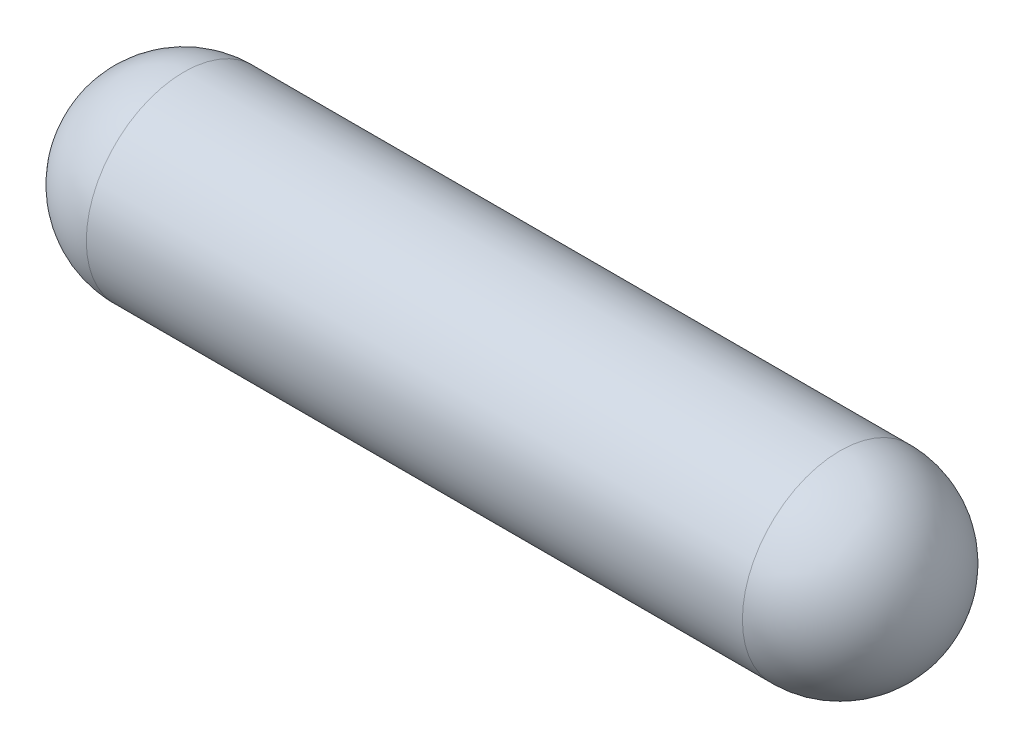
ISO-10303-21;
HEADER;
FILE_DESCRIPTION(('STEP AP214'),'2;1');
FILE_NAME('part.step','',(''),(''),'','','');
FILE_SCHEMA(('AUTOMOTIVE_DESIGN { 1 0 10303 214 1 1 1 1 }'));
ENDSEC;
DATA;
#1=APPLICATION_CONTEXT('core data for automotive mechanical design processes');
#2=APPLICATION_PROTOCOL_DEFINITION('international standard','automotive_design',2000,#1);
#3=PRODUCT_CONTEXT('',#1,'mechanical');
#4=PRODUCT('Part','Part','',(#3));
#5=PRODUCT_RELATED_PRODUCT_CATEGORY('part','',(#4));
#6=PRODUCT_DEFINITION_FORMATION('','',#4);
#7=PRODUCT_DEFINITION_CONTEXT('part definition',#1,'design');
#8=PRODUCT_DEFINITION('design','',#6,#7);
#9=PRODUCT_DEFINITION_SHAPE('','',#8);
#10=(LENGTH_UNIT() NAMED_UNIT(*) SI_UNIT(.MILLI.,.METRE.));
#11=(NAMED_UNIT(*) PLANE_ANGLE_UNIT() SI_UNIT($,.RADIAN.));
#12=(NAMED_UNIT(*) SI_UNIT($,.STERADIAN.) SOLID_ANGLE_UNIT());
#13=UNCERTAINTY_MEASURE_WITH_UNIT(LENGTH_MEASURE(1.E-05),#10,'distance_accuracy_value','');
#14=(GEOMETRIC_REPRESENTATION_CONTEXT(3) GLOBAL_UNCERTAINTY_ASSIGNED_CONTEXT((#13)) GLOBAL_UNIT_ASSIGNED_CONTEXT((#10,
#11,#12)) REPRESENTATION_CONTEXT('',''));
#15=CARTESIAN_POINT('',(0.,0.,0.));
#16=DIRECTION('',(0.,0.,1.));
#17=DIRECTION('',(1.,0.,0.));
#18=AXIS2_PLACEMENT_3D('',#15,#16,#17);
#19=CARTESIAN_POINT('',(-18.4404,2.3876,0.));
#20=DIRECTION('',(0.,0.,1.));
#21=DIRECTION('',(1.,0.,0.));
#22=AXIS2_PLACEMENT_3D('',#19,#20,#21);
#23=SPHERICAL_SURFACE('',#22,2.38759999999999);
#24=CARTESIAN_POINT('',(-18.4404,2.3876,0.));
#25=DIRECTION('',(-1.,0.,0.));
#26=DIRECTION('',(0.,0.,1.));
#27=AXIS2_PLACEMENT_3D('',#24,#25,#26);
#28=SPHERICAL_SURFACE('',#27,2.38759999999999);
#29=CARTESIAN_POINT('',(-18.4404,2.3876,0.));
#30=DIRECTION('',(-1.,0.,0.));
#31=DIRECTION('',(0.,0.,1.));
#32=AXIS2_PLACEMENT_3D('',#29,#30,#31);
#33=CIRCLE('',#32,2.38759999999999);
#34=CARTESIAN_POINT('',(-18.4404,2.3876,2.38759999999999));
#35=VERTEX_POINT('',#34);
#36=EDGE_CURVE('E33',#35,#35,#33,.T.);
#37=ORIENTED_EDGE('',*,*,#36,.T.);
#38=EDGE_LOOP('',(#37));
#39=FACE_BOUND('',#38,.T.);
#40=ADVANCED_FACE('F27',(#39),#28,.T.);
#41=CARTESIAN_POINT('',(-2.3876,2.3876,0.));
#42=DIRECTION('',(0.,0.,1.));
#43=DIRECTION('',(1.,0.,0.));
#44=AXIS2_PLACEMENT_3D('',#41,#42,#43);
#45=SPHERICAL_SURFACE('',#44,2.3876);
#46=CARTESIAN_POINT('',(-2.3876,2.3876,0.));
#47=DIRECTION('',(-1.,0.,0.));
#48=DIRECTION('',(0.,0.,1.));
#49=AXIS2_PLACEMENT_3D('',#46,#47,#48);
#50=SPHERICAL_SURFACE('',#49,2.3876);
#51=CARTESIAN_POINT('',(-2.3876,2.3876,0.));
#52=DIRECTION('',(-1.,0.,0.));
#53=DIRECTION('',(0.,0.,1.));
#54=AXIS2_PLACEMENT_3D('',#51,#52,#53);
#55=CIRCLE('',#54,2.3876);
#56=CARTESIAN_POINT('',(-2.3876,2.3876,2.3876));
#57=VERTEX_POINT('',#56);
#58=EDGE_CURVE('E10',#57,#57,#55,.T.);
#59=ORIENTED_EDGE('',*,*,#58,.F.);
#60=EDGE_LOOP('',(#59));
#61=FACE_BOUND('',#60,.T.);
#62=ADVANCED_FACE('F42',(#61),#50,.T.);
#63=CARTESIAN_POINT('',(0.,2.3876,0.));
#64=DIRECTION('',(-1.,0.,0.));
#65=DIRECTION('',(0.,0.,1.));
#66=AXIS2_PLACEMENT_3D('',#63,#64,#65);
#67=CYLINDRICAL_SURFACE('',#66,2.38759999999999);
#68=ORIENTED_EDGE('',*,*,#58,.T.);
#69=EDGE_LOOP('',(#68));
#70=FACE_BOUND('',#69,.T.);
#71=ORIENTED_EDGE('',*,*,#36,.F.);
#72=EDGE_LOOP('',(#71));
#73=FACE_BOUND('',#72,.T.);
#74=ADVANCED_FACE('F40',(#70,#73),#67,.T.);
#75=CLOSED_SHELL('',(#40,#62,#74));
#76=MANIFOLD_SOLID_BREP('B2',#75);
#77=ADVANCED_BREP_SHAPE_REPRESENTATION('',(#18,#76),#14);
#78=SHAPE_DEFINITION_REPRESENTATION(#9,#77);
ENDSEC;
END-ISO-10303-21;
